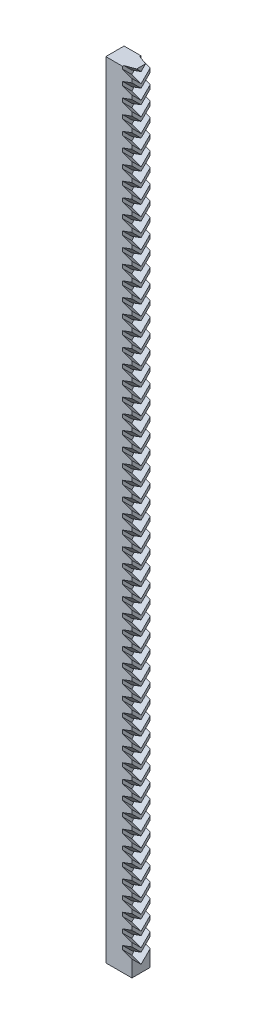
from build123d import *

# Parameters (mm, degrees)
SKETCH2_W           = 10
SKETCH2_H           = 300
BOSS_EXTRUDE2_DEPTH = 3.5
LPATTERN2_COUNT     = 54
LPATTERN2_PITCH     = 5.5


with BuildPart() as part:
    # Sketch2 → Boss-Extrude2 (new, symmetric)
    with BuildSketch(Plane.XY):
        with Locations((-3.25, 142.4726196)):
            Rectangle(SKETCH2_W, SKETCH2_H)
    extrude(amount=BOSS_EXTRUDE2_DEPTH, both=True)

    # Sketch4 → Cut-Loft1 section 0
    with BuildSketch(Plane.XY):
        with BuildLine():
            Line((1.75, -0.7374989), (-1.8, -2.0295932))
            Line((-1.8, -2.0295932), (-1.8, -3.4681939))
            Line((-1.8, -3.4681939), (1.75, -4.7602883))
            Line((1.75, -4.7602883), (1.75, -0.7374989))
        make_face()
    # Sketch6 → Cut-Loft1 section 1
    with BuildSketch(Plane(origin=(0, 3.5, 3.5), x_dir=(1, 0, 0), z_dir=(0, 0, 1))):
        with BuildLine():
            Line((1.75, -0.7374989), (-1.8, -2.0295932))
            Line((-1.8, -2.0295932), (-1.8, -3.4681939))
            Line((-1.8, -3.4681939), (1.75, -4.7602883))
            Line((1.75, -4.7602883), (1.75, -0.7374989))
        make_face()
    cut_loft1 = loft(mode=Mode.SUBTRACT)

    # Sketch4_3 → Cut-Loft2 section 0
    with BuildSketch(Plane.XY):
        with BuildLine():
            Line((1.75, -0.7374989), (-1.8, -2.0295932))
            Line((-1.8, -2.0295932), (-1.8, -3.4681939))
            Line((-1.8, -3.4681939), (1.75, -4.7602883))
            Line((1.75, -4.7602883), (1.75, -0.7374989))
        make_face()
    # Sketch7 → Cut-Loft2 section 1
    with BuildSketch(Plane(origin=(0, 3.5, -3.5), x_dir=(1, 0, 0), z_dir=(0, 0, 1))):
        with BuildLine():
            Line((1.75, -0.7374989), (-1.8, -2.0295932))
            Line((-1.8, -2.0295932), (-1.8, -3.4681939))
            Line((-1.8, -3.4681939), (1.75, -4.7602883))
            Line((1.75, -4.7602883), (1.75, -0.7374989))
        make_face()
    cut_loft2 = loft(mode=Mode.SUBTRACT)

    # LPattern2: Cut-Loft1, Cut-Loft2 ×54
    with Locations(*[(0, i * LPATTERN2_PITCH, 0) for i in range(1, LPATTERN2_COUNT)]):
        add(cut_loft1, mode=Mode.SUBTRACT)
        add(cut_loft2, mode=Mode.SUBTRACT)


solid = part.part
